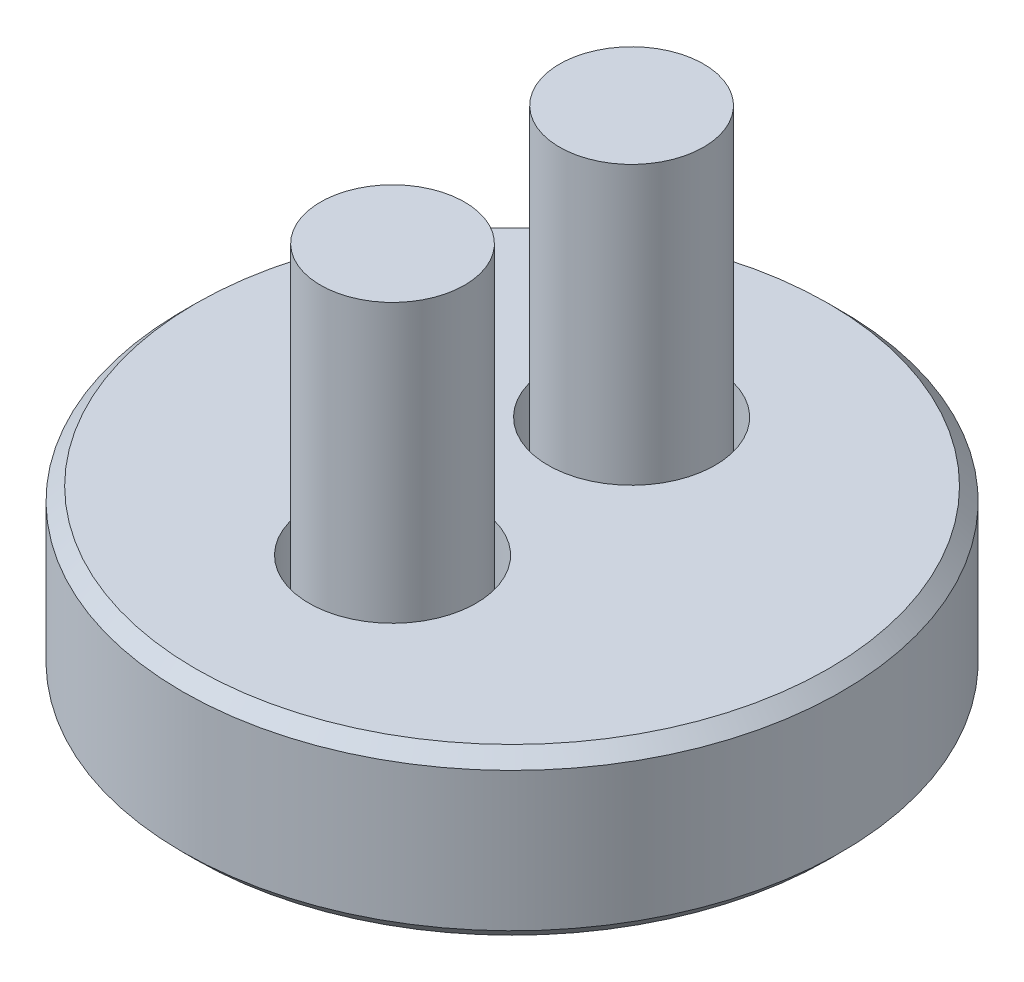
ISO-10303-21;
HEADER;
FILE_DESCRIPTION(('STEP AP214'),'2;1');
FILE_NAME('part.step','',(''),(''),'','','');
FILE_SCHEMA(('AUTOMOTIVE_DESIGN { 1 0 10303 214 1 1 1 1 }'));
ENDSEC;
DATA;
#1=APPLICATION_CONTEXT('core data for automotive mechanical design processes');
#2=APPLICATION_PROTOCOL_DEFINITION('international standard','automotive_design',2000,#1);
#3=PRODUCT_CONTEXT('',#1,'mechanical');
#4=PRODUCT('Part','Part','',(#3));
#5=PRODUCT_RELATED_PRODUCT_CATEGORY('part','',(#4));
#6=PRODUCT_DEFINITION_FORMATION('','',#4);
#7=PRODUCT_DEFINITION_CONTEXT('part definition',#1,'design');
#8=PRODUCT_DEFINITION('design','',#6,#7);
#9=PRODUCT_DEFINITION_SHAPE('','',#8);
#10=(LENGTH_UNIT() NAMED_UNIT(*) SI_UNIT(.MILLI.,.METRE.));
#11=(NAMED_UNIT(*) PLANE_ANGLE_UNIT() SI_UNIT($,.RADIAN.));
#12=(NAMED_UNIT(*) SI_UNIT($,.STERADIAN.) SOLID_ANGLE_UNIT());
#13=UNCERTAINTY_MEASURE_WITH_UNIT(LENGTH_MEASURE(1.E-05),#10,'distance_accuracy_value','');
#14=(GEOMETRIC_REPRESENTATION_CONTEXT(3) GLOBAL_UNCERTAINTY_ASSIGNED_CONTEXT((#13)) GLOBAL_UNIT_ASSIGNED_CONTEXT((#10,
#11,#12)) REPRESENTATION_CONTEXT('',''));
#15=CARTESIAN_POINT('',(0.,0.,0.));
#16=DIRECTION('',(0.,0.,1.));
#17=DIRECTION('',(1.,0.,0.));
#18=AXIS2_PLACEMENT_3D('',#15,#16,#17);
#19=CARTESIAN_POINT('',(0.,12.573,-3.4544));
#20=DIRECTION('',(0.,1.,0.));
#21=DIRECTION('',(1.,0.,0.));
#22=AXIS2_PLACEMENT_3D('',#19,#20,#21);
#23=PLANE('',#22);
#24=CARTESIAN_POINT('',(0.,12.573,-3.4544));
#25=DIRECTION('',(0.,-1.,0.));
#26=DIRECTION('',(1.,0.,0.));
#27=AXIS2_PLACEMENT_3D('',#24,#25,#26);
#28=CIRCLE('',#27,2.0828);
#29=CARTESIAN_POINT('',(2.0828,12.573,-3.4544));
#30=VERTEX_POINT('',#29);
#31=EDGE_CURVE('E12',#30,#30,#28,.T.);
#32=ORIENTED_EDGE('',*,*,#31,.F.);
#33=EDGE_LOOP('',(#32));
#34=FACE_BOUND('',#33,.T.);
#35=ADVANCED_FACE('F47',(#34),#23,.T.);
#36=CARTESIAN_POINT('',(0.,12.573,-3.4544));
#37=DIRECTION('',(0.,1.,0.));
#38=DIRECTION('',(1.,0.,0.));
#39=AXIS2_PLACEMENT_3D('',#36,#37,#38);
#40=CYLINDRICAL_SURFACE('',#39,2.0828);
#41=CARTESIAN_POINT('',(0.,3.048,-3.4544));
#42=DIRECTION('',(0.,-1.,0.));
#43=DIRECTION('',(1.,0.,0.));
#44=AXIS2_PLACEMENT_3D('',#41,#42,#43);
#45=CIRCLE('',#44,2.0828);
#46=CARTESIAN_POINT('',(2.0828,3.048,-3.4544));
#47=VERTEX_POINT('',#46);
#48=EDGE_CURVE('E54',#47,#47,#45,.T.);
#49=ORIENTED_EDGE('',*,*,#48,.F.);
#50=EDGE_LOOP('',(#49));
#51=FACE_BOUND('',#50,.T.);
#52=ORIENTED_EDGE('',*,*,#31,.T.);
#53=EDGE_LOOP('',(#52));
#54=FACE_BOUND('',#53,.T.);
#55=ADVANCED_FACE('F146',(#51,#54),#40,.T.);
#56=CARTESIAN_POINT('',(0.,3.048,-5.5372));
#57=DIRECTION('',(0.,1.,0.));
#58=DIRECTION('',(1.,0.,0.));
#59=AXIS2_PLACEMENT_3D('',#56,#57,#58);
#60=PLANE('',#59);
#61=CARTESIAN_POINT('',(0.,3.048,-3.4544));
#62=DIRECTION('',(0.,-1.,0.));
#63=DIRECTION('',(1.,0.,0.));
#64=AXIS2_PLACEMENT_3D('',#61,#62,#63);
#65=CIRCLE('',#64,3.429);
#66=CARTESIAN_POINT('',(3.429,3.048,-3.4544));
#67=VERTEX_POINT('',#66);
#68=EDGE_CURVE('E139',#67,#67,#65,.T.);
#69=ORIENTED_EDGE('',*,*,#68,.F.);
#70=EDGE_LOOP('',(#69));
#71=FACE_BOUND('',#70,.T.);
#72=ORIENTED_EDGE('',*,*,#48,.T.);
#73=EDGE_LOOP('',(#72));
#74=FACE_BOUND('',#73,.T.);
#75=ADVANCED_FACE('F144',(#71,#74),#60,.T.);
#76=CARTESIAN_POINT('',(0.,12.573,-3.4544));
#77=DIRECTION('',(0.,1.,0.));
#78=DIRECTION('',(1.,0.,0.));
#79=AXIS2_PLACEMENT_3D('',#76,#77,#78);
#80=CYLINDRICAL_SURFACE('',#79,3.429);
#81=CARTESIAN_POINT('',(0.,1.0668,-3.4544));
#82=DIRECTION('',(0.,-1.,0.));
#83=DIRECTION('',(1.,0.,0.));
#84=AXIS2_PLACEMENT_3D('',#81,#82,#83);
#85=CIRCLE('',#84,3.429);
#86=CARTESIAN_POINT('',(3.429,1.0668,-3.4544));
#87=VERTEX_POINT('',#86);
#88=EDGE_CURVE('E136',#87,#87,#85,.T.);
#89=ORIENTED_EDGE('',*,*,#88,.F.);
#90=EDGE_LOOP('',(#89));
#91=FACE_BOUND('',#90,.T.);
#92=ORIENTED_EDGE('',*,*,#68,.T.);
#93=EDGE_LOOP('',(#92));
#94=FACE_BOUND('',#93,.T.);
#95=ADVANCED_FACE('F164',(#91,#94),#80,.T.);
#96=CARTESIAN_POINT('',(0.,1.0668,-6.8834));
#97=DIRECTION('',(0.,-1.,0.));
#98=DIRECTION('',(-1.,0.,0.));
#99=AXIS2_PLACEMENT_3D('',#96,#97,#98);
#100=PLANE('',#99);
#101=DIRECTION('',(0.866025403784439,0.,-0.5));
#102=VECTOR('',#101,1.);
#103=CARTESIAN_POINT('',(0.,1.0668,-2.31055364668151));
#104=LINE('',#103,#102);
#105=CARTESIAN_POINT('',(0.,1.0668,-2.31055364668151));
#106=VERTEX_POINT('',#105);
#107=CARTESIAN_POINT('',(0.990599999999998,1.0668,-2.88247682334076));
#108=VERTEX_POINT('',#107);
#109=EDGE_CURVE('E262',#106,#108,#104,.T.);
#110=ORIENTED_EDGE('',*,*,#109,.T.);
#111=DIRECTION('',(0.,0.,-1.));
#112=VECTOR('',#111,1.);
#113=CARTESIAN_POINT('',(0.990599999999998,1.0668,-2.88247682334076));
#114=LINE('',#113,#112);
#115=CARTESIAN_POINT('',(0.990599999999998,1.0668,-4.02632317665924));
#116=VERTEX_POINT('',#115);
#117=EDGE_CURVE('E256',#108,#116,#114,.T.);
#118=ORIENTED_EDGE('',*,*,#117,.T.);
#119=DIRECTION('',(-0.866025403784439,0.,-0.5));
#120=VECTOR('',#119,1.);
#121=CARTESIAN_POINT('',(0.990599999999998,1.0668,-4.02632317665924));
#122=LINE('',#121,#120);
#123=CARTESIAN_POINT('',(0.,1.0668,-4.59824635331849));
#124=VERTEX_POINT('',#123);
#125=EDGE_CURVE('E261',#116,#124,#122,.T.);
#126=ORIENTED_EDGE('',*,*,#125,.T.);
#127=DIRECTION('',(-0.866025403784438,0.,0.5));
#128=VECTOR('',#127,1.);
#129=CARTESIAN_POINT('',(0.,1.0668,-4.59824635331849));
#130=LINE('',#129,#128);
#131=CARTESIAN_POINT('',(-0.990600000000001,1.0668,-4.02632317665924));
#132=VERTEX_POINT('',#131);
#133=EDGE_CURVE('E270',#124,#132,#130,.T.);
#134=ORIENTED_EDGE('',*,*,#133,.T.);
#135=DIRECTION('',(0.,0.,1.));
#136=VECTOR('',#135,1.);
#137=CARTESIAN_POINT('',(-0.990600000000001,1.0668,-4.02632317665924));
#138=LINE('',#137,#136);
#139=CARTESIAN_POINT('',(-0.990600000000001,1.0668,-2.88247682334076));
#140=VERTEX_POINT('',#139);
#141=EDGE_CURVE('E125',#132,#140,#138,.T.);
#142=ORIENTED_EDGE('',*,*,#141,.T.);
#143=DIRECTION('',(0.866025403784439,0.,0.5));
#144=VECTOR('',#143,1.);
#145=CARTESIAN_POINT('',(-0.990600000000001,1.0668,-2.88247682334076));
#146=LINE('',#145,#144);
#147=EDGE_CURVE('E265',#140,#106,#146,.T.);
#148=ORIENTED_EDGE('',*,*,#147,.T.);
#149=EDGE_LOOP('',(#110,#118,#126,#134,#142,#148));
#150=FACE_BOUND('',#149,.T.);
#151=ORIENTED_EDGE('',*,*,#88,.T.);
#152=EDGE_LOOP('',(#151));
#153=FACE_BOUND('',#152,.T.);
#154=ADVANCED_FACE('F172',(#150,#153),#100,.T.);
#155=CARTESIAN_POINT('',(0.,2.5908,-2.31055364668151));
#156=DIRECTION('',(0.5,0.,0.866025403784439));
#157=DIRECTION('',(-0.866025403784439,0.,0.5));
#158=AXIS2_PLACEMENT_3D('',#155,#156,#157);
#159=PLANE('',#158);
#160=ORIENTED_EDGE('',*,*,#109,.F.);
#161=DIRECTION('',(0.,-1.,0.));
#162=VECTOR('',#161,1.);
#163=CARTESIAN_POINT('',(0.,2.5908,-2.31055364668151));
#164=LINE('',#163,#162);
#165=CARTESIAN_POINT('',(0.,2.5908,-2.31055364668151));
#166=VERTEX_POINT('',#165);
#167=EDGE_CURVE('E92',#166,#106,#164,.T.);
#168=ORIENTED_EDGE('',*,*,#167,.F.);
#169=DIRECTION('',(0.866025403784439,0.,-0.5));
#170=VECTOR('',#169,1.);
#171=CARTESIAN_POINT('',(0.,2.5908,-2.31055364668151));
#172=LINE('',#171,#170);
#173=CARTESIAN_POINT('',(0.990599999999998,2.5908,-2.88247682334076));
#174=VERTEX_POINT('',#173);
#175=EDGE_CURVE('E273',#166,#174,#172,.T.);
#176=ORIENTED_EDGE('',*,*,#175,.T.);
#177=DIRECTION('',(0.,-1.,0.));
#178=VECTOR('',#177,1.);
#179=CARTESIAN_POINT('',(0.990599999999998,2.5908,-2.88247682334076));
#180=LINE('',#179,#178);
#181=EDGE_CURVE('E61',#174,#108,#180,.T.);
#182=ORIENTED_EDGE('',*,*,#181,.T.);
#183=EDGE_LOOP('',(#160,#168,#176,#182));
#184=FACE_BOUND('',#183,.T.);
#185=ADVANCED_FACE('F180',(#184),#159,.F.);
#186=CARTESIAN_POINT('',(-0.990600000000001,2.5908,-2.88247682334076));
#187=DIRECTION('',(-0.5,0.,0.866025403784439));
#188=DIRECTION('',(-0.866025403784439,0.,-0.5));
#189=AXIS2_PLACEMENT_3D('',#186,#187,#188);
#190=PLANE('',#189);
#191=ORIENTED_EDGE('',*,*,#147,.F.);
#192=DIRECTION('',(0.,-1.,0.));
#193=VECTOR('',#192,1.);
#194=CARTESIAN_POINT('',(-0.990600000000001,2.5908,-2.88247682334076));
#195=LINE('',#194,#193);
#196=CARTESIAN_POINT('',(-0.990600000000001,2.5908,-2.88247682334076));
#197=VERTEX_POINT('',#196);
#198=EDGE_CURVE('E127',#197,#140,#195,.T.);
#199=ORIENTED_EDGE('',*,*,#198,.F.);
#200=DIRECTION('',(0.866025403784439,0.,0.5));
#201=VECTOR('',#200,1.);
#202=CARTESIAN_POINT('',(-0.990600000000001,2.5908,-2.88247682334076));
#203=LINE('',#202,#201);
#204=EDGE_CURVE('E70',#197,#166,#203,.T.);
#205=ORIENTED_EDGE('',*,*,#204,.T.);
#206=ORIENTED_EDGE('',*,*,#167,.T.);
#207=EDGE_LOOP('',(#191,#199,#205,#206));
#208=FACE_BOUND('',#207,.T.);
#209=ADVANCED_FACE('F188',(#208),#190,.F.);
#210=CARTESIAN_POINT('',(-0.990600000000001,2.5908,-4.02632317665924));
#211=DIRECTION('',(-1.,0.,0.));
#212=DIRECTION('',(0.,0.,-1.));
#213=AXIS2_PLACEMENT_3D('',#210,#211,#212);
#214=PLANE('',#213);
#215=ORIENTED_EDGE('',*,*,#141,.F.);
#216=DIRECTION('',(0.,-1.,0.));
#217=VECTOR('',#216,1.);
#218=CARTESIAN_POINT('',(-0.990600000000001,2.5908,-4.02632317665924));
#219=LINE('',#218,#217);
#220=CARTESIAN_POINT('',(-0.990600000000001,2.5908,-4.02632317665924));
#221=VERTEX_POINT('',#220);
#222=EDGE_CURVE('E114',#221,#132,#219,.T.);
#223=ORIENTED_EDGE('',*,*,#222,.F.);
#224=DIRECTION('',(0.,0.,1.));
#225=VECTOR('',#224,1.);
#226=CARTESIAN_POINT('',(-0.990600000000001,2.5908,-4.02632317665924));
#227=LINE('',#226,#225);
#228=EDGE_CURVE('E117',#221,#197,#227,.T.);
#229=ORIENTED_EDGE('',*,*,#228,.T.);
#230=ORIENTED_EDGE('',*,*,#198,.T.);
#231=EDGE_LOOP('',(#215,#223,#229,#230));
#232=FACE_BOUND('',#231,.T.);
#233=ADVANCED_FACE('F123',(#232),#214,.F.);
#234=CARTESIAN_POINT('',(0.,2.5908,-4.59824635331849));
#235=DIRECTION('',(-0.5,0.,-0.866025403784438));
#236=DIRECTION('',(0.866025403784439,0.,-0.5));
#237=AXIS2_PLACEMENT_3D('',#234,#235,#236);
#238=PLANE('',#237);
#239=ORIENTED_EDGE('',*,*,#133,.F.);
#240=DIRECTION('',(0.,-1.,0.));
#241=VECTOR('',#240,1.);
#242=CARTESIAN_POINT('',(0.,2.5908,-4.59824635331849));
#243=LINE('',#242,#241);
#244=CARTESIAN_POINT('',(0.,2.5908,-4.59824635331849));
#245=VERTEX_POINT('',#244);
#246=EDGE_CURVE('E116',#245,#124,#243,.T.);
#247=ORIENTED_EDGE('',*,*,#246,.F.);
#248=DIRECTION('',(-0.866025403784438,0.,0.5));
#249=VECTOR('',#248,1.);
#250=CARTESIAN_POINT('',(0.,2.5908,-4.59824635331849));
#251=LINE('',#250,#249);
#252=EDGE_CURVE('E109',#245,#221,#251,.T.);
#253=ORIENTED_EDGE('',*,*,#252,.T.);
#254=ORIENTED_EDGE('',*,*,#222,.T.);
#255=EDGE_LOOP('',(#239,#247,#253,#254));
#256=FACE_BOUND('',#255,.T.);
#257=ADVANCED_FACE('F112',(#256),#238,.F.);
#258=CARTESIAN_POINT('',(0.990599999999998,2.5908,-4.02632317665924));
#259=DIRECTION('',(0.5,0.,-0.866025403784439));
#260=DIRECTION('',(0.866025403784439,0.,0.5));
#261=AXIS2_PLACEMENT_3D('',#258,#259,#260);
#262=PLANE('',#261);
#263=ORIENTED_EDGE('',*,*,#125,.F.);
#264=DIRECTION('',(0.,-1.,0.));
#265=VECTOR('',#264,1.);
#266=CARTESIAN_POINT('',(0.990599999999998,2.5908,-4.02632317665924));
#267=LINE('',#266,#265);
#268=CARTESIAN_POINT('',(0.990599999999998,2.5908,-4.02632317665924));
#269=VERTEX_POINT('',#268);
#270=EDGE_CURVE('E130',#269,#116,#267,.T.);
#271=ORIENTED_EDGE('',*,*,#270,.F.);
#272=DIRECTION('',(-0.866025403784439,0.,-0.5));
#273=VECTOR('',#272,1.);
#274=CARTESIAN_POINT('',(0.990599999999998,2.5908,-4.02632317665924));
#275=LINE('',#274,#273);
#276=EDGE_CURVE('E118',#269,#245,#275,.T.);
#277=ORIENTED_EDGE('',*,*,#276,.T.);
#278=ORIENTED_EDGE('',*,*,#246,.T.);
#279=EDGE_LOOP('',(#263,#271,#277,#278));
#280=FACE_BOUND('',#279,.T.);
#281=ADVANCED_FACE('F207',(#280),#262,.F.);
#282=CARTESIAN_POINT('',(0.990599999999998,2.5908,-2.88247682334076));
#283=DIRECTION('',(1.,0.,0.));
#284=DIRECTION('',(0.,-1.,0.));
#285=AXIS2_PLACEMENT_3D('',#282,#283,#284);
#286=PLANE('',#285);
#287=ORIENTED_EDGE('',*,*,#117,.F.);
#288=ORIENTED_EDGE('',*,*,#181,.F.);
#289=DIRECTION('',(0.,0.,-1.));
#290=VECTOR('',#289,1.);
#291=CARTESIAN_POINT('',(0.990599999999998,2.5908,-2.88247682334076));
#292=LINE('',#291,#290);
#293=EDGE_CURVE('E100',#174,#269,#292,.T.);
#294=ORIENTED_EDGE('',*,*,#293,.T.);
#295=ORIENTED_EDGE('',*,*,#270,.T.);
#296=EDGE_LOOP('',(#287,#288,#294,#295));
#297=FACE_BOUND('',#296,.T.);
#298=ADVANCED_FACE('F214',(#297),#286,.F.);
#299=CARTESIAN_POINT('',(1.9812,2.5908,-3.4544));
#300=DIRECTION('',(0.,-1.,0.));
#301=DIRECTION('',(-1.,0.,0.));
#302=AXIS2_PLACEMENT_3D('',#299,#300,#301);
#303=PLANE('',#302);
#304=ORIENTED_EDGE('',*,*,#175,.F.);
#305=ORIENTED_EDGE('',*,*,#204,.F.);
#306=ORIENTED_EDGE('',*,*,#228,.F.);
#307=ORIENTED_EDGE('',*,*,#252,.F.);
#308=ORIENTED_EDGE('',*,*,#276,.F.);
#309=ORIENTED_EDGE('',*,*,#293,.F.);
#310=EDGE_LOOP('',(#304,#305,#306,#307,#308,#309));
#311=FACE_BOUND('',#310,.T.);
#312=ADVANCED_FACE('F120',(#311),#303,.T.);
#313=CLOSED_SHELL('',(#35,#55,#75,#95,#154,#185,#209,#233,#257,#281,#298,#312));
#314=MANIFOLD_SOLID_BREP('B2',#313);
#315=CARTESIAN_POINT('',(0.,12.573,3.4544));
#316=DIRECTION('',(0.,1.,0.));
#317=DIRECTION('',(1.,0.,0.));
#318=AXIS2_PLACEMENT_3D('',#315,#316,#317);
#319=PLANE('',#318);
#320=CARTESIAN_POINT('',(0.,12.573,3.4544));
#321=DIRECTION('',(0.,1.,0.));
#322=DIRECTION('',(1.,0.,0.));
#323=AXIS2_PLACEMENT_3D('',#320,#321,#322);
#324=CIRCLE('',#323,2.0828);
#325=CARTESIAN_POINT('',(2.0828,12.573,3.4544));
#326=VERTEX_POINT('',#325);
#327=EDGE_CURVE('E45',#326,#326,#324,.T.);
#328=ORIENTED_EDGE('',*,*,#327,.T.);
#329=EDGE_LOOP('',(#328));
#330=FACE_BOUND('',#329,.T.);
#331=ADVANCED_FACE('F292',(#330),#319,.T.);
#332=CARTESIAN_POINT('',(0.,12.573,3.4544));
#333=DIRECTION('',(0.,1.,0.));
#334=DIRECTION('',(1.,0.,0.));
#335=AXIS2_PLACEMENT_3D('',#332,#333,#334);
#336=CYLINDRICAL_SURFACE('',#335,2.0828);
#337=CARTESIAN_POINT('',(0.,3.048,3.4544));
#338=DIRECTION('',(0.,1.,0.));
#339=DIRECTION('',(1.,0.,0.));
#340=AXIS2_PLACEMENT_3D('',#337,#338,#339);
#341=CIRCLE('',#340,2.0828);
#342=CARTESIAN_POINT('',(2.0828,3.048,3.4544));
#343=VERTEX_POINT('',#342);
#344=EDGE_CURVE('E299',#343,#343,#341,.T.);
#345=ORIENTED_EDGE('',*,*,#344,.T.);
#346=EDGE_LOOP('',(#345));
#347=FACE_BOUND('',#346,.T.);
#348=ORIENTED_EDGE('',*,*,#327,.F.);
#349=EDGE_LOOP('',(#348));
#350=FACE_BOUND('',#349,.T.);
#351=ADVANCED_FACE('F406',(#347,#350),#336,.T.);
#352=CARTESIAN_POINT('',(0.,3.048,5.5372));
#353=DIRECTION('',(0.,1.,0.));
#354=DIRECTION('',(1.,0.,0.));
#355=AXIS2_PLACEMENT_3D('',#352,#353,#354);
#356=PLANE('',#355);
#357=CARTESIAN_POINT('',(0.,3.048,3.4544));
#358=DIRECTION('',(0.,1.,0.));
#359=DIRECTION('',(1.,0.,0.));
#360=AXIS2_PLACEMENT_3D('',#357,#358,#359);
#361=CIRCLE('',#360,3.429);
#362=CARTESIAN_POINT('',(3.429,3.048,3.4544));
#363=VERTEX_POINT('',#362);
#364=EDGE_CURVE('E401',#363,#363,#361,.T.);
#365=ORIENTED_EDGE('',*,*,#364,.T.);
#366=EDGE_LOOP('',(#365));
#367=FACE_BOUND('',#366,.T.);
#368=ORIENTED_EDGE('',*,*,#344,.F.);
#369=EDGE_LOOP('',(#368));
#370=FACE_BOUND('',#369,.T.);
#371=ADVANCED_FACE('F409',(#367,#370),#356,.T.);
#372=CARTESIAN_POINT('',(0.,12.573,3.4544));
#373=DIRECTION('',(0.,1.,0.));
#374=DIRECTION('',(1.,0.,0.));
#375=AXIS2_PLACEMENT_3D('',#372,#373,#374);
#376=CYLINDRICAL_SURFACE('',#375,3.429);
#377=CARTESIAN_POINT('',(0.,1.0668,3.4544));
#378=DIRECTION('',(0.,1.,0.));
#379=DIRECTION('',(1.,0.,0.));
#380=AXIS2_PLACEMENT_3D('',#377,#378,#379);
#381=CIRCLE('',#380,3.429);
#382=CARTESIAN_POINT('',(3.429,1.0668,3.4544));
#383=VERTEX_POINT('',#382);
#384=EDGE_CURVE('E393',#383,#383,#381,.T.);
#385=ORIENTED_EDGE('',*,*,#384,.T.);
#386=EDGE_LOOP('',(#385));
#387=FACE_BOUND('',#386,.T.);
#388=ORIENTED_EDGE('',*,*,#364,.F.);
#389=EDGE_LOOP('',(#388));
#390=FACE_BOUND('',#389,.T.);
#391=ADVANCED_FACE('F411',(#387,#390),#376,.T.);
#392=CARTESIAN_POINT('',(0.,1.0668,6.8834));
#393=DIRECTION('',(0.,-1.,0.));
#394=DIRECTION('',(-1.,0.,0.));
#395=AXIS2_PLACEMENT_3D('',#392,#393,#394);
#396=PLANE('',#395);
#397=DIRECTION('',(0.866025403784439,0.,0.5));
#398=VECTOR('',#397,1.);
#399=CARTESIAN_POINT('',(0.,1.0668,2.31055364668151));
#400=LINE('',#399,#398);
#401=CARTESIAN_POINT('',(0.,1.0668,2.31055364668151));
#402=VERTEX_POINT('',#401);
#403=CARTESIAN_POINT('',(0.990599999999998,1.0668,2.88247682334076));
#404=VERTEX_POINT('',#403);
#405=EDGE_CURVE('E306',#402,#404,#400,.T.);
#406=ORIENTED_EDGE('',*,*,#405,.F.);
#407=DIRECTION('',(0.866025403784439,0.,-0.5));
#408=VECTOR('',#407,1.);
#409=CARTESIAN_POINT('',(-0.990600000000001,1.0668,2.88247682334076));
#410=LINE('',#409,#408);
#411=CARTESIAN_POINT('',(-0.990600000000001,1.0668,2.88247682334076));
#412=VERTEX_POINT('',#411);
#413=EDGE_CURVE('E389',#412,#402,#410,.T.);
#414=ORIENTED_EDGE('',*,*,#413,.F.);
#415=DIRECTION('',(0.,0.,-1.));
#416=VECTOR('',#415,1.);
#417=CARTESIAN_POINT('',(-0.990600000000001,1.0668,4.02632317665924));
#418=LINE('',#417,#416);
#419=CARTESIAN_POINT('',(-0.990600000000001,1.0668,4.02632317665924));
#420=VERTEX_POINT('',#419);
#421=EDGE_CURVE('E387',#420,#412,#418,.T.);
#422=ORIENTED_EDGE('',*,*,#421,.F.);
#423=DIRECTION('',(-0.866025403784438,0.,-0.5));
#424=VECTOR('',#423,1.);
#425=CARTESIAN_POINT('',(0.,1.0668,4.59824635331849));
#426=LINE('',#425,#424);
#427=CARTESIAN_POINT('',(0.,1.0668,4.59824635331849));
#428=VERTEX_POINT('',#427);
#429=EDGE_CURVE('E354',#428,#420,#426,.T.);
#430=ORIENTED_EDGE('',*,*,#429,.F.);
#431=DIRECTION('',(-0.866025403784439,0.,0.5));
#432=VECTOR('',#431,1.);
#433=CARTESIAN_POINT('',(0.990599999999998,1.0668,4.02632317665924));
#434=LINE('',#433,#432);
#435=CARTESIAN_POINT('',(0.990599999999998,1.0668,4.02632317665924));
#436=VERTEX_POINT('',#435);
#437=EDGE_CURVE('E383',#436,#428,#434,.T.);
#438=ORIENTED_EDGE('',*,*,#437,.F.);
#439=DIRECTION('',(0.,0.,1.));
#440=VECTOR('',#439,1.);
#441=CARTESIAN_POINT('',(0.990599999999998,1.0668,2.88247682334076));
#442=LINE('',#441,#440);
#443=EDGE_CURVE('E380',#404,#436,#442,.T.);
#444=ORIENTED_EDGE('',*,*,#443,.F.);
#445=EDGE_LOOP('',(#406,#414,#422,#430,#438,#444));
#446=FACE_BOUND('',#445,.T.);
#447=ORIENTED_EDGE('',*,*,#384,.F.);
#448=EDGE_LOOP('',(#447));
#449=FACE_BOUND('',#448,.T.);
#450=ADVANCED_FACE('F418',(#446,#449),#396,.T.);
#451=CARTESIAN_POINT('',(0.,2.5908,2.31055364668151));
#452=DIRECTION('',(0.5,0.,-0.866025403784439));
#453=DIRECTION('',(-0.866025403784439,0.,-0.5));
#454=AXIS2_PLACEMENT_3D('',#451,#452,#453);
#455=PLANE('',#454);
#456=ORIENTED_EDGE('',*,*,#405,.T.);
#457=DIRECTION('',(0.,-1.,0.));
#458=VECTOR('',#457,1.);
#459=CARTESIAN_POINT('',(0.990599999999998,2.5908,2.88247682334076));
#460=LINE('',#459,#458);
#461=CARTESIAN_POINT('',(0.990599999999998,2.5908,2.88247682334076));
#462=VERTEX_POINT('',#461);
#463=EDGE_CURVE('E336',#462,#404,#460,.T.);
#464=ORIENTED_EDGE('',*,*,#463,.F.);
#465=DIRECTION('',(0.866025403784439,0.,0.5));
#466=VECTOR('',#465,1.);
#467=CARTESIAN_POINT('',(0.,2.5908,2.31055364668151));
#468=LINE('',#467,#466);
#469=CARTESIAN_POINT('',(0.,2.5908,2.31055364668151));
#470=VERTEX_POINT('',#469);
#471=EDGE_CURVE('E391',#470,#462,#468,.T.);
#472=ORIENTED_EDGE('',*,*,#471,.F.);
#473=DIRECTION('',(0.,-1.,0.));
#474=VECTOR('',#473,1.);
#475=CARTESIAN_POINT('',(0.,2.5908,2.31055364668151));
#476=LINE('',#475,#474);
#477=EDGE_CURVE('E314',#470,#402,#476,.T.);
#478=ORIENTED_EDGE('',*,*,#477,.T.);
#479=EDGE_LOOP('',(#456,#464,#472,#478));
#480=FACE_BOUND('',#479,.T.);
#481=ADVANCED_FACE('F449',(#480),#455,.F.);
#482=CARTESIAN_POINT('',(-0.990600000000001,2.5908,2.88247682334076));
#483=DIRECTION('',(-0.5,0.,-0.866025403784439));
#484=DIRECTION('',(-0.866025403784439,0.,0.5));
#485=AXIS2_PLACEMENT_3D('',#482,#483,#484);
#486=PLANE('',#485);
#487=ORIENTED_EDGE('',*,*,#413,.T.);
#488=ORIENTED_EDGE('',*,*,#477,.F.);
#489=DIRECTION('',(0.866025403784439,0.,-0.5));
#490=VECTOR('',#489,1.);
#491=CARTESIAN_POINT('',(-0.990600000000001,2.5908,2.88247682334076));
#492=LINE('',#491,#490);
#493=CARTESIAN_POINT('',(-0.990600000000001,2.5908,2.88247682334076));
#494=VERTEX_POINT('',#493);
#495=EDGE_CURVE('E366',#494,#470,#492,.T.);
#496=ORIENTED_EDGE('',*,*,#495,.F.);
#497=DIRECTION('',(0.,-1.,0.));
#498=VECTOR('',#497,1.);
#499=CARTESIAN_POINT('',(-0.990600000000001,2.5908,2.88247682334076));
#500=LINE('',#499,#498);
#501=EDGE_CURVE('E358',#494,#412,#500,.T.);
#502=ORIENTED_EDGE('',*,*,#501,.T.);
#503=EDGE_LOOP('',(#487,#488,#496,#502));
#504=FACE_BOUND('',#503,.T.);
#505=ADVANCED_FACE('F459',(#504),#486,.F.);
#506=CARTESIAN_POINT('',(-0.990600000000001,2.5908,4.02632317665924));
#507=DIRECTION('',(-1.,0.,0.));
#508=DIRECTION('',(0.,0.,1.));
#509=AXIS2_PLACEMENT_3D('',#506,#507,#508);
#510=PLANE('',#509);
#511=ORIENTED_EDGE('',*,*,#421,.T.);
#512=ORIENTED_EDGE('',*,*,#501,.F.);
#513=DIRECTION('',(0.,0.,-1.));
#514=VECTOR('',#513,1.);
#515=CARTESIAN_POINT('',(-0.990600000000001,2.5908,4.02632317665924));
#516=LINE('',#515,#514);
#517=CARTESIAN_POINT('',(-0.990600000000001,2.5908,4.02632317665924));
#518=VERTEX_POINT('',#517);
#519=EDGE_CURVE('E362',#518,#494,#516,.T.);
#520=ORIENTED_EDGE('',*,*,#519,.F.);
#521=DIRECTION('',(0.,-1.,0.));
#522=VECTOR('',#521,1.);
#523=CARTESIAN_POINT('',(-0.990600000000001,2.5908,4.02632317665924));
#524=LINE('',#523,#522);
#525=EDGE_CURVE('E347',#518,#420,#524,.T.);
#526=ORIENTED_EDGE('',*,*,#525,.T.);
#527=EDGE_LOOP('',(#511,#512,#520,#526));
#528=FACE_BOUND('',#527,.T.);
#529=ADVANCED_FACE('F363',(#528),#510,.F.);
#530=CARTESIAN_POINT('',(0.,2.5908,4.59824635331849));
#531=DIRECTION('',(-0.5,0.,0.866025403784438));
#532=DIRECTION('',(0.866025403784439,0.,0.5));
#533=AXIS2_PLACEMENT_3D('',#530,#531,#532);
#534=PLANE('',#533);
#535=ORIENTED_EDGE('',*,*,#429,.T.);
#536=ORIENTED_EDGE('',*,*,#525,.F.);
#537=DIRECTION('',(-0.866025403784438,0.,-0.5));
#538=VECTOR('',#537,1.);
#539=CARTESIAN_POINT('',(0.,2.5908,4.59824635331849));
#540=LINE('',#539,#538);
#541=CARTESIAN_POINT('',(0.,2.5908,4.59824635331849));
#542=VERTEX_POINT('',#541);
#543=EDGE_CURVE('E351',#542,#518,#540,.T.);
#544=ORIENTED_EDGE('',*,*,#543,.F.);
#545=DIRECTION('',(0.,-1.,0.));
#546=VECTOR('',#545,1.);
#547=CARTESIAN_POINT('',(0.,2.5908,4.59824635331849));
#548=LINE('',#547,#546);
#549=EDGE_CURVE('E359',#542,#428,#548,.T.);
#550=ORIENTED_EDGE('',*,*,#549,.T.);
#551=EDGE_LOOP('',(#535,#536,#544,#550));
#552=FACE_BOUND('',#551,.T.);
#553=ADVANCED_FACE('F349',(#552),#534,.F.);
#554=CARTESIAN_POINT('',(0.990599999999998,2.5908,4.02632317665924));
#555=DIRECTION('',(0.5,0.,0.866025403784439));
#556=DIRECTION('',(0.866025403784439,0.,-0.5));
#557=AXIS2_PLACEMENT_3D('',#554,#555,#556);
#558=PLANE('',#557);
#559=ORIENTED_EDGE('',*,*,#437,.T.);
#560=ORIENTED_EDGE('',*,*,#549,.F.);
#561=DIRECTION('',(-0.866025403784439,0.,0.5));
#562=VECTOR('',#561,1.);
#563=CARTESIAN_POINT('',(0.990599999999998,2.5908,4.02632317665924));
#564=LINE('',#563,#562);
#565=CARTESIAN_POINT('',(0.990599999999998,2.5908,4.02632317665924));
#566=VERTEX_POINT('',#565);
#567=EDGE_CURVE('E372',#566,#542,#564,.T.);
#568=ORIENTED_EDGE('',*,*,#567,.F.);
#569=DIRECTION('',(0.,-1.,0.));
#570=VECTOR('',#569,1.);
#571=CARTESIAN_POINT('',(0.990599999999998,2.5908,4.02632317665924));
#572=LINE('',#571,#570);
#573=EDGE_CURVE('E396',#566,#436,#572,.T.);
#574=ORIENTED_EDGE('',*,*,#573,.T.);
#575=EDGE_LOOP('',(#559,#560,#568,#574));
#576=FACE_BOUND('',#575,.T.);
#577=ADVANCED_FACE('F484',(#576),#558,.F.);
#578=CARTESIAN_POINT('',(0.990599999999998,2.5908,2.88247682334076));
#579=DIRECTION('',(1.,0.,0.));
#580=DIRECTION('',(0.,-1.,0.));
#581=AXIS2_PLACEMENT_3D('',#578,#579,#580);
#582=PLANE('',#581);
#583=ORIENTED_EDGE('',*,*,#443,.T.);
#584=ORIENTED_EDGE('',*,*,#573,.F.);
#585=DIRECTION('',(0.,0.,1.));
#586=VECTOR('',#585,1.);
#587=CARTESIAN_POINT('',(0.990599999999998,2.5908,2.88247682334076));
#588=LINE('',#587,#586);
#589=EDGE_CURVE('E374',#462,#566,#588,.T.);
#590=ORIENTED_EDGE('',*,*,#589,.F.);
#591=ORIENTED_EDGE('',*,*,#463,.T.);
#592=EDGE_LOOP('',(#583,#584,#590,#591));
#593=FACE_BOUND('',#592,.T.);
#594=ADVANCED_FACE('F493',(#593),#582,.F.);
#595=CARTESIAN_POINT('',(1.9812,2.5908,3.4544));
#596=DIRECTION('',(0.,-1.,0.));
#597=DIRECTION('',(-1.,0.,0.));
#598=AXIS2_PLACEMENT_3D('',#595,#596,#597);
#599=PLANE('',#598);
#600=ORIENTED_EDGE('',*,*,#471,.T.);
#601=ORIENTED_EDGE('',*,*,#589,.T.);
#602=ORIENTED_EDGE('',*,*,#567,.T.);
#603=ORIENTED_EDGE('',*,*,#543,.T.);
#604=ORIENTED_EDGE('',*,*,#519,.T.);
#605=ORIENTED_EDGE('',*,*,#495,.T.);
#606=EDGE_LOOP('',(#600,#601,#602,#603,#604,#605));
#607=FACE_BOUND('',#606,.T.);
#608=ADVANCED_FACE('F369',(#607),#599,.T.);
#609=CLOSED_SHELL('',(#331,#351,#371,#391,#450,#481,#505,#529,#553,#577,#594,#608));
#610=MANIFOLD_SOLID_BREP('B6',#609);
#611=CARTESIAN_POINT('',(0.,4.7752,0.));
#612=DIRECTION('',(0.,-1.,0.));
#613=DIRECTION('',(0.,0.,-1.));
#614=AXIS2_PLACEMENT_3D('',#611,#612,#613);
#615=CYLINDRICAL_SURFACE('',#614,9.525);
#616=CARTESIAN_POINT('',(0.,0.380999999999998,0.));
#617=DIRECTION('',(0.,1.,0.));
#618=DIRECTION('',(0.,0.,1.));
#619=AXIS2_PLACEMENT_3D('',#616,#617,#618);
#620=CIRCLE('',#619,9.525);
#621=CARTESIAN_POINT('',(0.,0.380999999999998,9.525));
#622=VERTEX_POINT('',#621);
#623=EDGE_CURVE('E619',#622,#622,#620,.T.);
#624=ORIENTED_EDGE('',*,*,#623,.T.);
#625=EDGE_LOOP('',(#624));
#626=FACE_BOUND('',#625,.T.);
#627=CARTESIAN_POINT('',(0.,4.3942,0.));
#628=DIRECTION('',(0.,1.,0.));
#629=DIRECTION('',(0.,0.,1.));
#630=AXIS2_PLACEMENT_3D('',#627,#628,#629);
#631=CIRCLE('',#630,9.525);
#632=CARTESIAN_POINT('',(0.,4.3942,9.525));
#633=VERTEX_POINT('',#632);
#634=EDGE_CURVE('E616',#633,#633,#631,.F.);
#635=ORIENTED_EDGE('',*,*,#634,.T.);
#636=EDGE_LOOP('',(#635));
#637=FACE_BOUND('',#636,.T.);
#638=ADVANCED_FACE('F527',(#626,#637),#615,.T.);
#639=CARTESIAN_POINT('',(0.,4.7752,0.));
#640=DIRECTION('',(0.,1.,0.));
#641=DIRECTION('',(0.,0.,1.));
#642=AXIS2_PLACEMENT_3D('',#639,#640,#641);
#643=PLANE('',#642);
#644=CARTESIAN_POINT('',(0.,4.7752,-3.4544));
#645=DIRECTION('',(0.,-1.,0.));
#646=DIRECTION('',(0.,0.,-1.));
#647=AXIS2_PLACEMENT_3D('',#644,#645,#646);
#648=CIRCLE('',#647,2.413);
#649=CARTESIAN_POINT('',(0.,4.7752,-5.8674));
#650=VERTEX_POINT('',#649);
#651=EDGE_CURVE('E610',#650,#650,#648,.T.);
#652=ORIENTED_EDGE('',*,*,#651,.T.);
#653=EDGE_LOOP('',(#652));
#654=FACE_BOUND('',#653,.T.);
#655=CARTESIAN_POINT('',(0.,4.7752,3.4544));
#656=DIRECTION('',(0.,-1.,0.));
#657=DIRECTION('',(0.,0.,-1.));
#658=AXIS2_PLACEMENT_3D('',#655,#656,#657);
#659=CIRCLE('',#658,2.413);
#660=CARTESIAN_POINT('',(0.,4.7752,1.0414));
#661=VERTEX_POINT('',#660);
#662=EDGE_CURVE('E613',#661,#661,#659,.T.);
#663=ORIENTED_EDGE('',*,*,#662,.T.);
#664=EDGE_LOOP('',(#663));
#665=FACE_BOUND('',#664,.T.);
#666=CARTESIAN_POINT('',(0.,4.7752,0.));
#667=DIRECTION('',(0.,1.,0.));
#668=DIRECTION('',(0.,0.,1.));
#669=AXIS2_PLACEMENT_3D('',#666,#667,#668);
#670=CIRCLE('',#669,9.144);
#671=CARTESIAN_POINT('',(0.,4.7752,9.144));
#672=VERTEX_POINT('',#671);
#673=EDGE_CURVE('E290',#672,#672,#670,.T.);
#674=ORIENTED_EDGE('',*,*,#673,.T.);
#675=EDGE_LOOP('',(#674));
#676=FACE_BOUND('',#675,.T.);
#677=ADVANCED_FACE('F634',(#654,#665,#676),#643,.T.);
#678=CARTESIAN_POINT('',(0.,0.,0.));
#679=DIRECTION('',(0.,1.,0.));
#680=DIRECTION('',(0.,0.,1.));
#681=AXIS2_PLACEMENT_3D('',#678,#679,#680);
#682=PLANE('',#681);
#683=DIRECTION('',(0.,0.,1.));
#684=VECTOR('',#683,1.);
#685=CARTESIAN_POINT('',(4.064,0.,-3.4544));
#686=LINE('',#685,#684);
#687=CARTESIAN_POINT('',(4.064,0.,-3.4544));
#688=VERTEX_POINT('',#687);
#689=CARTESIAN_POINT('',(4.064,0.,3.4544));
#690=VERTEX_POINT('',#689);
#691=EDGE_CURVE('E578',#688,#690,#686,.T.);
#692=ORIENTED_EDGE('',*,*,#691,.F.);
#693=CARTESIAN_POINT('',(0.,0.,-3.4544));
#694=DIRECTION('',(0.,-1.,0.));
#695=DIRECTION('',(0.,0.,1.));
#696=AXIS2_PLACEMENT_3D('',#693,#694,#695);
#697=CIRCLE('',#696,4.064);
#698=CARTESIAN_POINT('',(-4.064,0.,-3.4544));
#699=VERTEX_POINT('',#698);
#700=EDGE_CURVE('E543',#699,#688,#697,.T.);
#701=ORIENTED_EDGE('',*,*,#700,.F.);
#702=DIRECTION('',(0.,0.,-1.));
#703=VECTOR('',#702,1.);
#704=CARTESIAN_POINT('',(-4.064,0.,-3.4544));
#705=LINE('',#704,#703);
#706=CARTESIAN_POINT('',(-4.064,0.,3.4544));
#707=VERTEX_POINT('',#706);
#708=EDGE_CURVE('E595',#707,#699,#705,.T.);
#709=ORIENTED_EDGE('',*,*,#708,.F.);
#710=CARTESIAN_POINT('',(0.,0.,3.4544));
#711=DIRECTION('',(0.,-1.,0.));
#712=DIRECTION('',(0.,0.,-1.));
#713=AXIS2_PLACEMENT_3D('',#710,#711,#712);
#714=CIRCLE('',#713,4.064);
#715=EDGE_CURVE('E601',#690,#707,#714,.T.);
#716=ORIENTED_EDGE('',*,*,#715,.F.);
#717=EDGE_LOOP('',(#692,#701,#709,#716));
#718=FACE_BOUND('',#717,.T.);
#719=CARTESIAN_POINT('',(0.,0.,0.));
#720=DIRECTION('',(0.,1.,0.));
#721=DIRECTION('',(0.,0.,1.));
#722=AXIS2_PLACEMENT_3D('',#719,#720,#721);
#723=CIRCLE('',#722,9.144);
#724=CARTESIAN_POINT('',(0.,0.,9.144));
#725=VERTEX_POINT('',#724);
#726=EDGE_CURVE('E536',#725,#725,#723,.F.);
#727=ORIENTED_EDGE('',*,*,#726,.T.);
#728=EDGE_LOOP('',(#727));
#729=FACE_BOUND('',#728,.T.);
#730=ADVANCED_FACE('F625',(#718,#729),#682,.F.);
#731=CARTESIAN_POINT('',(0.,0.380999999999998,0.));
#732=DIRECTION('',(0.,1.,0.));
#733=DIRECTION('',(0.,0.,1.));
#734=AXIS2_PLACEMENT_3D('',#731,#732,#733);
#735=CONICAL_SURFACE('',#734,9.525,0.785398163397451);
#736=ORIENTED_EDGE('',*,*,#726,.F.);
#737=EDGE_LOOP('',(#736));
#738=FACE_BOUND('',#737,.T.);
#739=ORIENTED_EDGE('',*,*,#623,.F.);
#740=EDGE_LOOP('',(#739));
#741=FACE_BOUND('',#740,.T.);
#742=ADVANCED_FACE('F627',(#738,#741),#735,.T.);
#743=CARTESIAN_POINT('',(0.,4.7752,0.));
#744=DIRECTION('',(0.,-1.,0.));
#745=DIRECTION('',(0.,0.,-1.));
#746=AXIS2_PLACEMENT_3D('',#743,#744,#745);
#747=CONICAL_SURFACE('',#746,9.144,0.785398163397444);
#748=ORIENTED_EDGE('',*,*,#634,.F.);
#749=EDGE_LOOP('',(#748));
#750=FACE_BOUND('',#749,.T.);
#751=ORIENTED_EDGE('',*,*,#673,.F.);
#752=EDGE_LOOP('',(#751));
#753=FACE_BOUND('',#752,.T.);
#754=ADVANCED_FACE('F529',(#750,#753),#747,.T.);
#755=CARTESIAN_POINT('',(0.,4.7752,3.4544));
#756=DIRECTION('',(0.,-1.,0.));
#757=DIRECTION('',(0.,0.,-1.));
#758=AXIS2_PLACEMENT_3D('',#755,#756,#757);
#759=CYLINDRICAL_SURFACE('',#758,2.413);
#760=CARTESIAN_POINT('',(0.,3.048,3.4544));
#761=DIRECTION('',(0.,1.,0.));
#762=DIRECTION('',(0.,0.,1.));
#763=AXIS2_PLACEMENT_3D('',#760,#761,#762);
#764=CIRCLE('',#763,2.413);
#765=CARTESIAN_POINT('',(0.,3.048,5.8674));
#766=VERTEX_POINT('',#765);
#767=EDGE_CURVE('E607',#766,#766,#764,.F.);
#768=ORIENTED_EDGE('',*,*,#767,.T.);
#769=EDGE_LOOP('',(#768));
#770=FACE_BOUND('',#769,.T.);
#771=ORIENTED_EDGE('',*,*,#662,.F.);
#772=EDGE_LOOP('',(#771));
#773=FACE_BOUND('',#772,.T.);
#774=ADVANCED_FACE('F640',(#770,#773),#759,.F.);
#775=CARTESIAN_POINT('',(0.,4.7752,-3.4544));
#776=DIRECTION('',(0.,-1.,0.));
#777=DIRECTION('',(0.,0.,-1.));
#778=AXIS2_PLACEMENT_3D('',#775,#776,#777);
#779=CYLINDRICAL_SURFACE('',#778,2.413);
#780=CARTESIAN_POINT('',(0.,3.048,-3.4544));
#781=DIRECTION('',(0.,1.,0.));
#782=DIRECTION('',(0.,0.,1.));
#783=AXIS2_PLACEMENT_3D('',#780,#781,#782);
#784=CIRCLE('',#783,2.413);
#785=CARTESIAN_POINT('',(0.,3.048,-1.0414));
#786=VERTEX_POINT('',#785);
#787=EDGE_CURVE('E531',#786,#786,#784,.F.);
#788=ORIENTED_EDGE('',*,*,#787,.T.);
#789=EDGE_LOOP('',(#788));
#790=FACE_BOUND('',#789,.T.);
#791=ORIENTED_EDGE('',*,*,#651,.F.);
#792=EDGE_LOOP('',(#791));
#793=FACE_BOUND('',#792,.T.);
#794=ADVANCED_FACE('F655',(#790,#793),#779,.F.);
#795=CARTESIAN_POINT('',(0.,3.048,-3.4544));
#796=DIRECTION('',(0.,1.,0.));
#797=DIRECTION('',(0.,0.,1.));
#798=AXIS2_PLACEMENT_3D('',#795,#796,#797);
#799=PLANE('',#798);
#800=ORIENTED_EDGE('',*,*,#787,.F.);
#801=EDGE_LOOP('',(#800));
#802=FACE_BOUND('',#801,.T.);
#803=CARTESIAN_POINT('',(0.,3.048,-3.4544));
#804=DIRECTION('',(0.,-1.,0.));
#805=DIRECTION('',(0.,0.,1.));
#806=AXIS2_PLACEMENT_3D('',#803,#804,#805);
#807=CIRCLE('',#806,4.064);
#808=CARTESIAN_POINT('',(-4.064,3.048,-3.4544));
#809=VERTEX_POINT('',#808);
#810=CARTESIAN_POINT('',(4.064,3.048,-3.4544));
#811=VERTEX_POINT('',#810);
#812=EDGE_CURVE('E593',#809,#811,#807,.T.);
#813=ORIENTED_EDGE('',*,*,#812,.T.);
#814=DIRECTION('',(0.,0.,1.));
#815=VECTOR('',#814,1.);
#816=CARTESIAN_POINT('',(4.064,3.048,-3.4544));
#817=LINE('',#816,#815);
#818=CARTESIAN_POINT('',(4.064,3.048,3.4544));
#819=VERTEX_POINT('',#818);
#820=EDGE_CURVE('E575',#811,#819,#817,.T.);
#821=ORIENTED_EDGE('',*,*,#820,.T.);
#822=CARTESIAN_POINT('',(0.,3.048,3.4544));
#823=DIRECTION('',(0.,-1.,0.));
#824=DIRECTION('',(0.,0.,-1.));
#825=AXIS2_PLACEMENT_3D('',#822,#823,#824);
#826=CIRCLE('',#825,4.064);
#827=CARTESIAN_POINT('',(-4.064,3.048,3.4544));
#828=VERTEX_POINT('',#827);
#829=EDGE_CURVE('E585',#819,#828,#826,.T.);
#830=ORIENTED_EDGE('',*,*,#829,.T.);
#831=DIRECTION('',(0.,0.,-1.));
#832=VECTOR('',#831,1.);
#833=CARTESIAN_POINT('',(-4.064,3.048,-3.4544));
#834=LINE('',#833,#832);
#835=EDGE_CURVE('E589',#828,#809,#834,.T.);
#836=ORIENTED_EDGE('',*,*,#835,.T.);
#837=EDGE_LOOP('',(#813,#821,#830,#836));
#838=FACE_BOUND('',#837,.T.);
#839=ORIENTED_EDGE('',*,*,#767,.F.);
#840=EDGE_LOOP('',(#839));
#841=FACE_BOUND('',#840,.T.);
#842=ADVANCED_FACE('F591',(#802,#838,#841),#799,.F.);
#843=CARTESIAN_POINT('',(0.,3.048,-3.4544));
#844=DIRECTION('',(0.,-1.,0.));
#845=DIRECTION('',(0.,0.,-1.));
#846=AXIS2_PLACEMENT_3D('',#843,#844,#845);
#847=CYLINDRICAL_SURFACE('',#846,4.064);
#848=ORIENTED_EDGE('',*,*,#700,.T.);
#849=DIRECTION('',(0.,-1.,0.));
#850=VECTOR('',#849,1.);
#851=CARTESIAN_POINT('',(4.064,3.048,-3.4544));
#852=LINE('',#851,#850);
#853=EDGE_CURVE('E566',#811,#688,#852,.T.);
#854=ORIENTED_EDGE('',*,*,#853,.F.);
#855=ORIENTED_EDGE('',*,*,#812,.F.);
#856=DIRECTION('',(0.,-1.,0.));
#857=VECTOR('',#856,1.);
#858=CARTESIAN_POINT('',(-4.064,3.048,-3.4544));
#859=LINE('',#858,#857);
#860=EDGE_CURVE('E551',#809,#699,#859,.T.);
#861=ORIENTED_EDGE('',*,*,#860,.T.);
#862=EDGE_LOOP('',(#848,#854,#855,#861));
#863=FACE_BOUND('',#862,.T.);
#864=ADVANCED_FACE('F660',(#863),#847,.F.);
#865=CARTESIAN_POINT('',(-4.064,3.048,-3.4544));
#866=DIRECTION('',(-1.,0.,0.));
#867=DIRECTION('',(0.,0.,1.));
#868=AXIS2_PLACEMENT_3D('',#865,#866,#867);
#869=PLANE('',#868);
#870=ORIENTED_EDGE('',*,*,#708,.T.);
#871=ORIENTED_EDGE('',*,*,#860,.F.);
#872=ORIENTED_EDGE('',*,*,#835,.F.);
#873=DIRECTION('',(0.,-1.,0.));
#874=VECTOR('',#873,1.);
#875=CARTESIAN_POINT('',(-4.064,3.048,3.4544));
#876=LINE('',#875,#874);
#877=EDGE_CURVE('E582',#828,#707,#876,.T.);
#878=ORIENTED_EDGE('',*,*,#877,.T.);
#879=EDGE_LOOP('',(#870,#871,#872,#878));
#880=FACE_BOUND('',#879,.T.);
#881=ADVANCED_FACE('F663',(#880),#869,.F.);
#882=CARTESIAN_POINT('',(0.,3.048,3.4544));
#883=DIRECTION('',(0.,-1.,0.));
#884=DIRECTION('',(0.,0.,-1.));
#885=AXIS2_PLACEMENT_3D('',#882,#883,#884);
#886=CYLINDRICAL_SURFACE('',#885,4.064);
#887=ORIENTED_EDGE('',*,*,#715,.T.);
#888=ORIENTED_EDGE('',*,*,#877,.F.);
#889=ORIENTED_EDGE('',*,*,#829,.F.);
#890=DIRECTION('',(0.,-1.,0.));
#891=VECTOR('',#890,1.);
#892=CARTESIAN_POINT('',(4.064,3.048,3.4544));
#893=LINE('',#892,#891);
#894=EDGE_CURVE('E571',#819,#690,#893,.T.);
#895=ORIENTED_EDGE('',*,*,#894,.T.);
#896=EDGE_LOOP('',(#887,#888,#889,#895));
#897=FACE_BOUND('',#896,.T.);
#898=ADVANCED_FACE('F586',(#897),#886,.F.);
#899=CARTESIAN_POINT('',(4.064,3.048,-3.4544));
#900=DIRECTION('',(1.,0.,0.));
#901=DIRECTION('',(0.,0.,-1.));
#902=AXIS2_PLACEMENT_3D('',#899,#900,#901);
#903=PLANE('',#902);
#904=ORIENTED_EDGE('',*,*,#691,.T.);
#905=ORIENTED_EDGE('',*,*,#894,.F.);
#906=ORIENTED_EDGE('',*,*,#820,.F.);
#907=ORIENTED_EDGE('',*,*,#853,.T.);
#908=EDGE_LOOP('',(#904,#905,#906,#907));
#909=FACE_BOUND('',#908,.T.);
#910=ADVANCED_FACE('F573',(#909),#903,.F.);
#911=CLOSED_SHELL('',(#638,#677,#730,#742,#754,#774,#794,#842,#864,#881,#898,#910));
#912=MANIFOLD_SOLID_BREP('B39',#911);
#913=ADVANCED_BREP_SHAPE_REPRESENTATION('',(#18,#314,#610,#912),#14);
#914=SHAPE_DEFINITION_REPRESENTATION(#9,#913);
ENDSEC;
END-ISO-10303-21;
